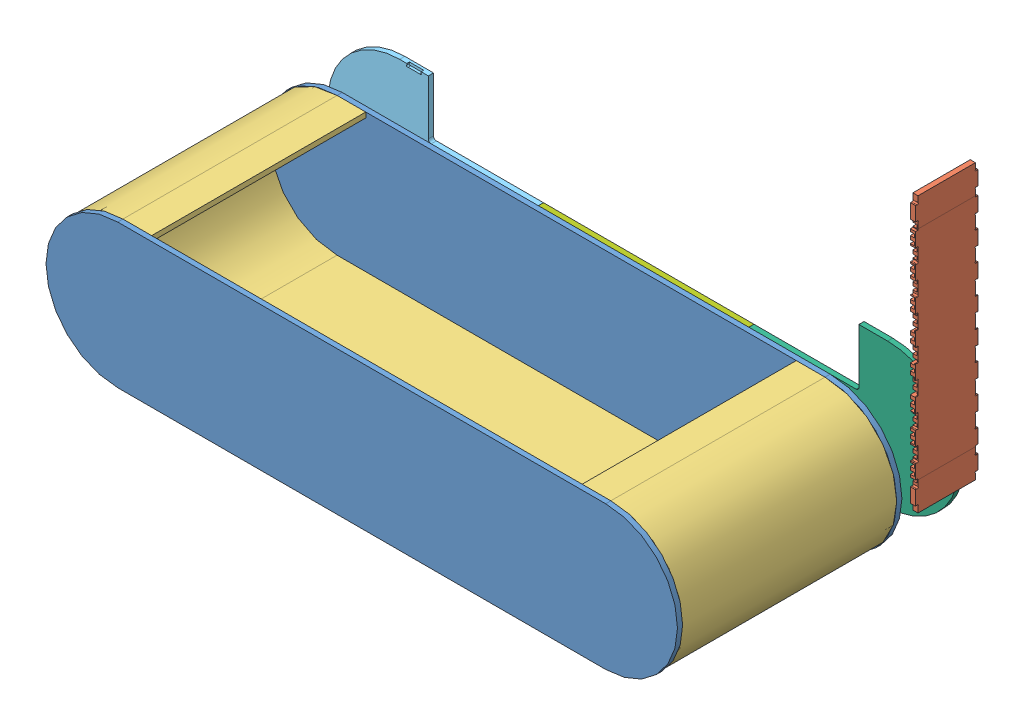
SolidWorks assembly Assemblage2.SLDASM, configuration Défaut (file format 10000). Lengths in mm.
Overall size (2410.21 1644.83 1000).
9 component instances, 8 part files, 18 mates.
Components (placement in the parent):
- BarPièce1b-2: BarPièce1b.SLDPRT [Défaut] at origin size (2200 500 18)
- BarPièce1b-3: BarPièce1b.SLDPRT [Défaut] at (0 0 -764) size (2200 500 18)
- Pièce3-2: Pièce3.SLDPRT [Défaut] at (239.504 -894.5449 -630.153) x (-1 0 0) z (0 0 -1) size (18 1171.28 300.83)
- Pièce4-1: Pièce4.SLDPRT [Défaut] at origin size (2200 500 746)
- Pièce5-1: Pièce5.SLDPRT [Défaut] at (0 -250 -864) size (1500 18 200)
- bare plaque dessus1-3-1: bare plaque dessus1-3.SLDPRT [Défaut] at (0 0 -964) x (-1 0 0) z (0 0 -1) size (1495.98 522.58 18)
- bare plaque dessus3-3-1: bare plaque dessus3-3.SLDPRT [Défaut] at (0 0 -964) x (-1 0 0) z (0 0 -1) size (1489.61 550.85 18)
- bare plaque dessus2-3-1: bare plaque dessus2-3.SLDPRT [Défaut] at (0 -200 -964) x (1 0 0) z (0 0 -1) size (921.17 552.88 18)
- support -1: support .SLDPRT [Défaut] at (-387.6633 -232 -764) x (0 1 0) z (-1 0 0) size (291 209 18)
Mates (geometry in assembly coordinates):
- Coïncidente11: coincident aligned: line of BarPièce1b-3 through (-850 -250 -746) axis (1 0 0); line of Pièce4-1 through (-850 -250 -746) axis (1 0 0)
- Coïncidente15: coincident aligned: circle of BarPièce1b-3; circle of Pièce4-1
- Coïncidente18: coincident: circle of Pièce3-2; plane of bare plaque dessus3-3-1 through (-850 0 -964) normal (0 0 1)
- Coïncidente19: coincident: circle of Pièce3-2; circle of bare plaque dessus3-3-1
- Coïncidente25: coincident aligned: line of BarPièce1b-3 through (-850 -250 -764) axis (1 0 0); line of Pièce5-1 through (-750 -250 -764) axis (1 0 0)
- Coïncidente27: coincident aligned: line of Pièce5-1 through (750 -250 -964) axis (-1 0 0); line of bare plaque dessus1-3-1 through (-366.6667 -250 -964) axis (-1 0 0)
- Coïncidente28: coincident: circle of BarPièce1b-3; circle of Pièce3-2
- Coïncidente29: coincident: line of Pièce3-2 through (750 250 -764) axis (0 0 -1); line of Pièce4-1 through (750 250 -746) axis (0 0 1)
- Coïncidente30: coincident: line of Pièce3-2 through (750 250 -964) axis (1 0 0); line of bare plaque dessus3-3-1 through (750 250 -964) axis (1 0 0)
- Coïncidente31: coincident aligned: line of BarPièce1b-2 through (1700 -850 -250) axis (0 1 0); line of Pièce4-1 through (1700 -850 -250) axis (0 1 0)
- Coïncidente32: coincident aligned: circle of BarPièce1b-2; circle of Pièce4-1
- Coïncidente34: coincident anti-aligned: line of bare plaque dessus1-3-1 through (-366.6667 -120 -982) axis (0 1 0); line of bare plaque dessus2-3-1 through (-366.6667 -80 -982) axis (0 -1 0)
- Coïncidente35: coincident anti-aligned: line of bare plaque dessus3-3-1 through (740 50 -982) axis (-1 0 0); line of bare plaque dessus2-3-1 through (-366.6667 50 -982) axis (1 0 0)
- Coïncidente36: coincident anti-aligned: plane of bare plaque dessus1-3-1 through (-403.5453 -210.1213 -973) normal (0 0 1); plane of support -1 through (-405.6633 -232 -973) normal (0 0 -1)
- Coïncidente37: coincident anti-aligned: plane of Pièce5-1 through (0 -232 -864) normal (0 1 0); plane of support -1 through (-405.6633 -232 -882.5819) normal (0 -1 0)
- Coïncidente38: coincident: line of bare plaque dessus2-3-1 through (-405.6633 -150.2426 -964) axis (0 -1 0); plane of support -1 through (-405.6633 -234.11 -787.89) normal (-1 0 0)
- Coïncidente41: coincident anti-aligned: plane of bare plaque dessus3-3-1 through (426.6667 0 -994) normal (-1 0 0); plane of bare plaque dessus2-3-1 through (426.6667 -190 -994) normal (1 0 0)
- Coïncidente42: coincident aligned: circle of BarPièce1b-3; cylinder of Pièce4-1 through (-850 0 -746) axis (0 0 1) radius 250
